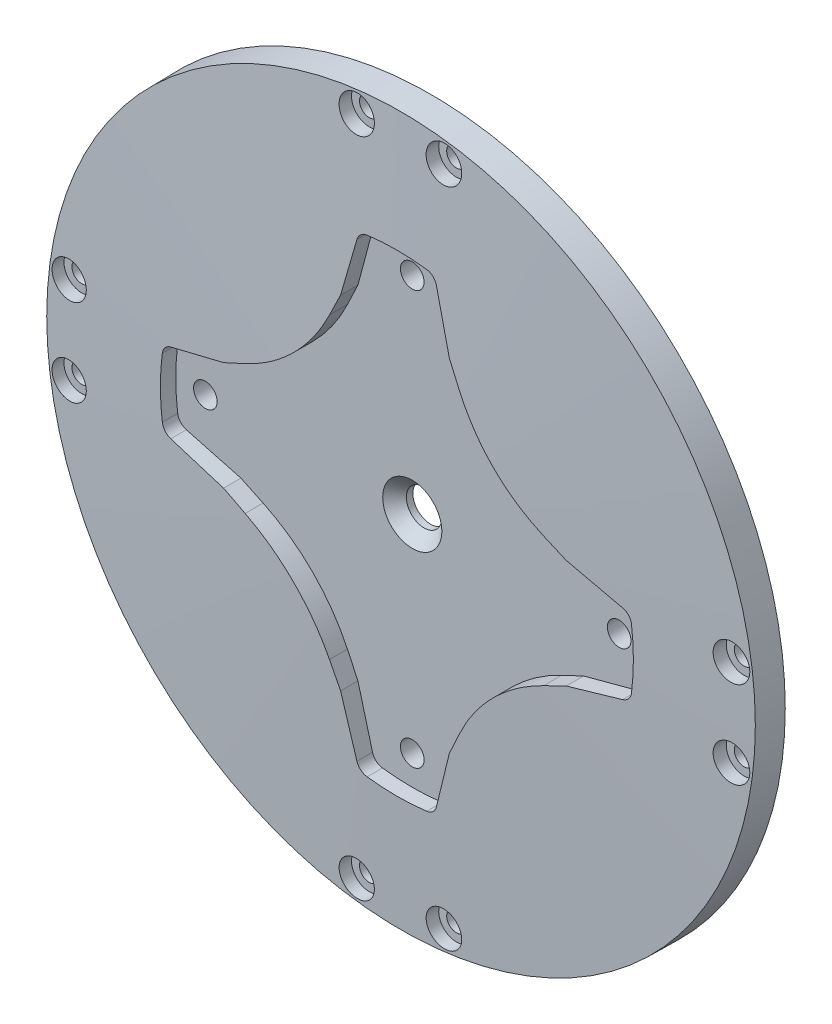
from build123d import *

# Parameters (mm, degrees)
SKETCH3_R          = 1.65
CUT_EXTRUDE2_DEPTH = 163.256344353
SKETCH5_R          = 3
CUT_EXTRUDE3_DEPTH = 163.152901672
CIRPATTERN2_COUNT  = 4
CUT_EXTRUDE4_DEPTH = 4
FILLET1_R          = 2
SKETCH7_R          = 2
CUT_EXTRUDE5_DEPTH = 163.13203303
SKETCH8_R          = 3
CUT_EXTRUDE6_DEPTH = 163.13203303
CHAMFER1_SIZE      = 2


with BuildPart() as part:
    # Sketch2 → Revolve1 (revolve)
    with BuildSketch(Plane(origin=(20.658597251, 80.609394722, -41), x_dir=(1, 0, 0), z_dir=(0, -1, 0))):
        Polygon((-60, 41), (-59.934546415, 46), (0, 48.09296048), (0, 41), align=None)
    revolve(axis=Axis((20.658597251, 80.609394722, 0), (0, 0, 1)))

    # Sketch3 → Cut-Extrude2 (cut, through all)
    with BuildSketch(Plane(origin=(0, 0, 0), x_dir=(-1, 0, 0), z_dir=(0, 0, -1))):
        with Locations((-28.033327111, 24.592760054)):
            Circle(SKETCH3_R)
        with Locations((-13.28386739, 24.592760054)):
            Circle(SKETCH3_R)
        with Locations((-76.675231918, 87.984124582)):
            Circle(SKETCH3_R)
        with Locations((-76.675231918, 73.234664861)):
            Circle(SKETCH3_R)
        with Locations((-13.28386739, 136.626029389)):
            Circle(SKETCH3_R)
        with Locations((-28.033327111, 136.626029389)):
            Circle(SKETCH3_R)
        with Locations((35.358037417, 73.234664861)):
            Circle(SKETCH3_R)
        with Locations((35.358037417, 87.984124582)):
            Circle(SKETCH3_R)
    extrude(amount=-CUT_EXTRUDE2_DEPTH, mode=Mode.SUBTRACT)

    # Sketch5 → Cut-Extrude3 (cut, through all)
    with BuildSketch(Plane(origin=(0, 0, 3), x_dir=(-1, 0, 0), z_dir=(0, 0, -1))):
        with Locations((-13.28386739, 136.626029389)):
            Circle(SKETCH5_R)
        with Locations((-28.033327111, 136.626029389)):
            Circle(SKETCH5_R)
    cut_extrude3 = extrude(amount=-CUT_EXTRUDE3_DEPTH, mode=Mode.SUBTRACT)

    # CirPattern2: Cut-Extrude3 ×4 about axis
    cirpattern2_axis = Axis((20.658597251, 80.609394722, 0), (0, 0, 1))
    for i in range(1, CIRPATTERN2_COUNT):
        add(cut_extrude3.rotate(cirpattern2_axis, i * 360 / CIRPATTERN2_COUNT), mode=Mode.SUBTRACT)

    # Sketch6 → Cut-Extrude4 (cut)
    with BuildSketch(Plane(origin=(0, 0, 7.1), x_dir=(-1, 0, 0), z_dir=(0, 0, -1))):
        with BuildLine():
            Line((-27.038439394, 120.097337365), (-29.850985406, 109.60077275))
            Line((-29.850985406, 109.60077275), (-31.628307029, 105.848649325))
            ThreePointArc((-31.628307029, 105.848649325), (-37.52723876, 97.478036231), (-45.897851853, 91.5791045))
            Line((-45.897851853, 91.5791045), (-49.649975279, 89.801782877))
            Line((-49.649975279, 89.801782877), (-60.146539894, 86.989236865))
            ThreePointArc((-60.146539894, 86.989236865), (-60.658597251, 80.609394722), (-60.146539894, 74.229552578))
            Line((-60.146539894, 74.229552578), (-49.649975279, 71.417006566))
            Line((-49.649975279, 71.417006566), (-45.897851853, 69.639684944))
            ThreePointArc((-45.897851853, 69.639684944), (-37.52723876, 63.740753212), (-31.628307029, 55.370140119))
            Line((-31.628307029, 55.370140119), (-29.850985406, 51.618016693))
            Line((-29.850985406, 51.618016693), (-27.038439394, 41.121452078))
            ThreePointArc((-27.038439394, 41.121452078), (-20.658597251, 40.609394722), (-14.278755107, 41.121452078))
            Line((-14.278755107, 41.121452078), (-11.466209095, 51.618016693))
            Line((-11.466209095, 51.618016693), (-9.688887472, 55.370140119))
            ThreePointArc((-9.688887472, 55.370140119), (-3.789955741, 63.740753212), (4.580657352, 69.639684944))
            Line((4.580657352, 69.639684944), (8.332780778, 71.417006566))
            Line((8.332780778, 71.417006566), (18.829345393, 74.229552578))
            ThreePointArc((18.829345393, 74.229552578), (19.213182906, 77.409215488), (19.341402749, 80.609394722))
            ThreePointArc((19.341402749, 80.609394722), (19.213182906, 83.809573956), (18.829345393, 86.989236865))
            Line((18.829345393, 86.989236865), (8.332780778, 89.801782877))
            Line((8.332780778, 89.801782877), (4.580657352, 91.5791045))
            ThreePointArc((4.580657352, 91.5791045), (-3.789955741, 97.478036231), (-9.688887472, 105.848649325))
            Line((-9.688887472, 105.848649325), (-11.466209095, 109.60077275))
            Line((-11.466209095, 109.60077275), (-14.278755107, 120.097337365))
            ThreePointArc((-14.278755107, 120.097337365), (-20.658597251, 120.609394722), (-27.038439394, 120.097337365))
        make_face()
    extrude(amount=CUT_EXTRUDE4_DEPTH, mode=Mode.SUBTRACT)

    # Fillet1
    fillet1_edges = [part.edges().sort_by_distance(p)[0] for p in [
        (60.146539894, 86.989236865, 4.39806485),
        (60.146539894, 74.229552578, 4.39806485),
        (-18.829345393, 74.229552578, 4.39806485),
        (27.038439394, 41.121452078, 4.39806485),
        (14.278755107, 41.121452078, 4.39806485),
        (-18.829345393, 86.989236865, 4.39806485),
        (14.278755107, 120.097337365, 4.39806485),
        (27.038439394, 120.097337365, 4.39806485),
    ]]
    fillet(fillet1_edges, radius=FILLET1_R)

    # Sketch7 → Cut-Extrude5 (cut, through all)
    with BuildSketch(Plane.XY.offset(3.1)):
        with Locations((55.658597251, 80.609394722)):
            Circle(SKETCH7_R)
        with Locations((20.658597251, 115.609394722)):
            Circle(SKETCH7_R)
        with Locations((20.658597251, 45.609394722)):
            Circle(SKETCH7_R)
        with Locations((-14.341402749, 80.609394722)):
            Circle(SKETCH7_R)
    extrude(amount=-CUT_EXTRUDE5_DEPTH, mode=Mode.SUBTRACT)

    # Sketch8 → Cut-Extrude6 (cut, through all)
    with BuildSketch(Plane.XY.offset(3.1)):
        with Locations((20.658597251, 80.609394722)):
            Circle(SKETCH8_R)
    extrude(amount=-CUT_EXTRUDE6_DEPTH, mode=Mode.SUBTRACT)

    # Chamfer1
    chamfer1_edges = [part.edges().sort_by_distance(p)[0] for p in [
        (17.658597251, 80.609394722, 3.1),
    ]]
    chamfer(chamfer1_edges, length=CHAMFER1_SIZE)


solid = part.part
